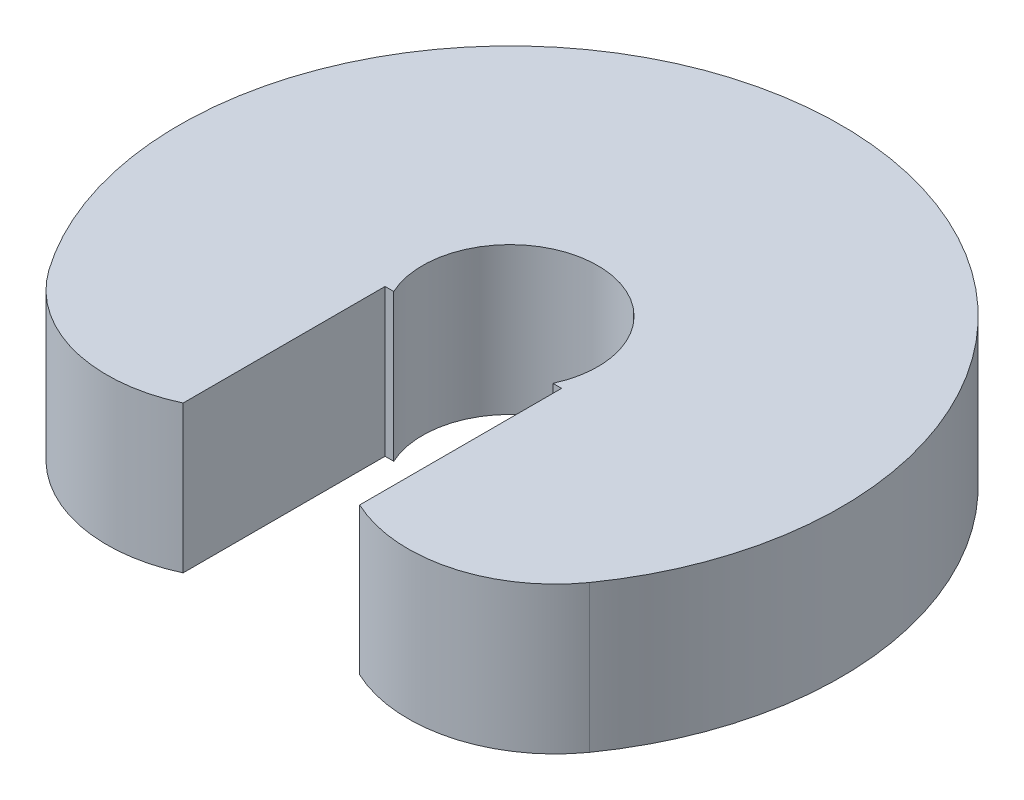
ISO-10303-21;
HEADER;
FILE_DESCRIPTION(('STEP AP214'),'2;1');
FILE_NAME('part.step','',(''),(''),'','','');
FILE_SCHEMA(('AUTOMOTIVE_DESIGN { 1 0 10303 214 1 1 1 1 }'));
ENDSEC;
DATA;
#1=APPLICATION_CONTEXT('core data for automotive mechanical design processes');
#2=APPLICATION_PROTOCOL_DEFINITION('international standard','automotive_design',2000,#1);
#3=PRODUCT_CONTEXT('',#1,'mechanical');
#4=PRODUCT('Part','Part','',(#3));
#5=PRODUCT_RELATED_PRODUCT_CATEGORY('part','',(#4));
#6=PRODUCT_DEFINITION_FORMATION('','',#4);
#7=PRODUCT_DEFINITION_CONTEXT('part definition',#1,'design');
#8=PRODUCT_DEFINITION('design','',#6,#7);
#9=PRODUCT_DEFINITION_SHAPE('','',#8);
#10=(LENGTH_UNIT() NAMED_UNIT(*) SI_UNIT(.MILLI.,.METRE.));
#11=(NAMED_UNIT(*) PLANE_ANGLE_UNIT() SI_UNIT($,.RADIAN.));
#12=(NAMED_UNIT(*) SI_UNIT($,.STERADIAN.) SOLID_ANGLE_UNIT());
#13=UNCERTAINTY_MEASURE_WITH_UNIT(LENGTH_MEASURE(1.E-05),#10,'distance_accuracy_value','');
#14=(GEOMETRIC_REPRESENTATION_CONTEXT(3) GLOBAL_UNCERTAINTY_ASSIGNED_CONTEXT((#13)) GLOBAL_UNIT_ASSIGNED_CONTEXT((#10,
#11,#12)) REPRESENTATION_CONTEXT('',''));
#15=CARTESIAN_POINT('',(0.,0.,0.));
#16=DIRECTION('',(0.,0.,1.));
#17=DIRECTION('',(1.,0.,0.));
#18=AXIS2_PLACEMENT_3D('',#15,#16,#17);
#19=CARTESIAN_POINT('',(0.,100.,0.));
#20=DIRECTION('',(0.,-1.,0.));
#21=DIRECTION('',(0.,0.,-1.));
#22=AXIS2_PLACEMENT_3D('',#19,#20,#21);
#23=CYLINDRICAL_SURFACE('',#22,225.);
#24=CARTESIAN_POINT('',(0.,0.,0.));
#25=DIRECTION('',(0.,1.,0.));
#26=DIRECTION('',(1.,0.,0.));
#27=AXIS2_PLACEMENT_3D('',#24,#25,#26);
#28=CIRCLE('',#27,225.);
#29=CARTESIAN_POINT('',(183.716642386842,0.,129.896864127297));
#30=VERTEX_POINT('',#29);
#31=CARTESIAN_POINT('',(-183.716642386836,0.,129.896864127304));
#32=VERTEX_POINT('',#31);
#33=EDGE_CURVE('E11',#30,#32,#28,.T.);
#34=ORIENTED_EDGE('',*,*,#33,.T.);
#35=DIRECTION('',(0.,-1.,0.));
#36=VECTOR('',#35,1.);
#37=CARTESIAN_POINT('',(-183.716642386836,100.,129.896864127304));
#38=LINE('',#37,#36);
#39=CARTESIAN_POINT('',(-183.716642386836,100.,129.896864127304));
#40=VERTEX_POINT('',#39);
#41=EDGE_CURVE('E41',#40,#32,#38,.T.);
#42=ORIENTED_EDGE('',*,*,#41,.F.);
#43=CARTESIAN_POINT('',(0.,100.,0.));
#44=DIRECTION('',(0.,1.,0.));
#45=DIRECTION('',(1.,0.,0.));
#46=AXIS2_PLACEMENT_3D('',#43,#44,#45);
#47=CIRCLE('',#46,225.);
#48=CARTESIAN_POINT('',(183.716642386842,100.,129.896864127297));
#49=VERTEX_POINT('',#48);
#50=EDGE_CURVE('E130',#49,#40,#47,.T.);
#51=ORIENTED_EDGE('',*,*,#50,.F.);
#52=DIRECTION('',(0.,-1.,0.));
#53=VECTOR('',#52,1.);
#54=CARTESIAN_POINT('',(183.716642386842,100.,129.896864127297));
#55=LINE('',#54,#53);
#56=EDGE_CURVE('E27',#49,#30,#55,.T.);
#57=ORIENTED_EDGE('',*,*,#56,.T.);
#58=EDGE_LOOP('',(#34,#42,#51,#57));
#59=FACE_BOUND('',#58,.T.);
#60=ADVANCED_FACE('F16',(#59),#23,.T.);
#61=CARTESIAN_POINT('',(-102.394005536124,100.,71.6970545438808));
#62=DIRECTION('',(0.,-1.,0.));
#63=DIRECTION('',(0.,0.,-1.));
#64=AXIS2_PLACEMENT_3D('',#61,#62,#63);
#65=CYLINDRICAL_SURFACE('',#64,100.002945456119);
#66=CARTESIAN_POINT('',(-102.394005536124,0.,71.6970545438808));
#67=DIRECTION('',(0.,1.,0.));
#68=DIRECTION('',(1.,0.,0.));
#69=AXIS2_PLACEMENT_3D('',#66,#67,#68);
#70=CIRCLE('',#69,100.002945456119);
#71=CARTESIAN_POINT('',(-60.,0.,162.269331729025));
#72=VERTEX_POINT('',#71);
#73=EDGE_CURVE('E133',#32,#72,#70,.T.);
#74=ORIENTED_EDGE('',*,*,#73,.T.);
#75=DIRECTION('',(0.,-1.,0.));
#76=VECTOR('',#75,1.);
#77=CARTESIAN_POINT('',(-60.,100.,162.269331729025));
#78=LINE('',#77,#76);
#79=CARTESIAN_POINT('',(-60.,100.,162.269331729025));
#80=VERTEX_POINT('',#79);
#81=EDGE_CURVE('E123',#80,#72,#78,.T.);
#82=ORIENTED_EDGE('',*,*,#81,.F.);
#83=CARTESIAN_POINT('',(-102.394005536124,100.,71.6970545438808));
#84=DIRECTION('',(0.,1.,0.));
#85=DIRECTION('',(1.,0.,0.));
#86=AXIS2_PLACEMENT_3D('',#83,#84,#85);
#87=CIRCLE('',#86,100.002945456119);
#88=EDGE_CURVE('E20',#40,#80,#87,.T.);
#89=ORIENTED_EDGE('',*,*,#88,.F.);
#90=ORIENTED_EDGE('',*,*,#41,.T.);
#91=EDGE_LOOP('',(#74,#82,#89,#90));
#92=FACE_BOUND('',#91,.T.);
#93=ADVANCED_FACE('F276',(#92),#65,.T.);
#94=CARTESIAN_POINT('',(-60.,100.,162.269331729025));
#95=DIRECTION('',(-1.,0.,0.));
#96=DIRECTION('',(0.,0.,1.));
#97=AXIS2_PLACEMENT_3D('',#94,#95,#96);
#98=PLANE('',#97);
#99=DIRECTION('',(0.,0.,-1.));
#100=VECTOR('',#99,1.);
#101=CARTESIAN_POINT('',(-60.,0.,162.269331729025));
#102=LINE('',#101,#100);
#103=CARTESIAN_POINT('',(-60.,0.,25.));
#104=VERTEX_POINT('',#103);
#105=EDGE_CURVE('E162',#72,#104,#102,.T.);
#106=ORIENTED_EDGE('',*,*,#105,.T.);
#107=DIRECTION('',(0.,-1.,0.));
#108=VECTOR('',#107,1.);
#109=CARTESIAN_POINT('',(-60.,100.,25.));
#110=LINE('',#109,#108);
#111=CARTESIAN_POINT('',(-60.,100.,25.));
#112=VERTEX_POINT('',#111);
#113=EDGE_CURVE('E159',#112,#104,#110,.T.);
#114=ORIENTED_EDGE('',*,*,#113,.F.);
#115=DIRECTION('',(0.,0.,-1.));
#116=VECTOR('',#115,1.);
#117=CARTESIAN_POINT('',(-60.,100.,162.269331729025));
#118=LINE('',#117,#116);
#119=EDGE_CURVE('E97',#80,#112,#118,.T.);
#120=ORIENTED_EDGE('',*,*,#119,.F.);
#121=ORIENTED_EDGE('',*,*,#81,.T.);
#122=EDGE_LOOP('',(#106,#114,#120,#121));
#123=FACE_BOUND('',#122,.T.);
#124=ADVANCED_FACE('F327',(#123),#98,.F.);
#125=CARTESIAN_POINT('',(-60.,100.,25.));
#126=DIRECTION('',(0.,0.,-1.));
#127=DIRECTION('',(-1.,0.,0.));
#128=AXIS2_PLACEMENT_3D('',#125,#126,#127);
#129=PLANE('',#128);
#130=DIRECTION('',(1.,0.,0.));
#131=VECTOR('',#130,1.);
#132=CARTESIAN_POINT('',(-60.,0.,25.));
#133=LINE('',#132,#131);
#134=CARTESIAN_POINT('',(-54.1032346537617,0.,25.));
#135=VERTEX_POINT('',#134);
#136=EDGE_CURVE('E156',#104,#135,#133,.T.);
#137=ORIENTED_EDGE('',*,*,#136,.T.);
#138=DIRECTION('',(0.,-1.,0.));
#139=VECTOR('',#138,1.);
#140=CARTESIAN_POINT('',(-54.1032346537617,100.,25.));
#141=LINE('',#140,#139);
#142=CARTESIAN_POINT('',(-54.1032346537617,100.,25.));
#143=VERTEX_POINT('',#142);
#144=EDGE_CURVE('E108',#143,#135,#141,.T.);
#145=ORIENTED_EDGE('',*,*,#144,.F.);
#146=DIRECTION('',(1.,0.,0.));
#147=VECTOR('',#146,1.);
#148=CARTESIAN_POINT('',(-60.,100.,25.));
#149=LINE('',#148,#147);
#150=EDGE_CURVE('E171',#112,#143,#149,.T.);
#151=ORIENTED_EDGE('',*,*,#150,.F.);
#152=ORIENTED_EDGE('',*,*,#113,.T.);
#153=EDGE_LOOP('',(#137,#145,#151,#152));
#154=FACE_BOUND('',#153,.T.);
#155=ADVANCED_FACE('F322',(#154),#129,.F.);
#156=CARTESIAN_POINT('',(0.,100.,0.));
#157=DIRECTION('',(0.,-1.,0.));
#158=DIRECTION('',(0.,0.,-1.));
#159=AXIS2_PLACEMENT_3D('',#156,#157,#158);
#160=CYLINDRICAL_SURFACE('',#159,59.6);
#161=CARTESIAN_POINT('',(0.,0.,0.));
#162=DIRECTION('',(0.,1.,0.));
#163=DIRECTION('',(1.,0.,0.));
#164=AXIS2_PLACEMENT_3D('',#161,#162,#163);
#165=CIRCLE('',#164,59.6);
#166=CARTESIAN_POINT('',(54.1032346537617,0.,25.));
#167=VERTEX_POINT('',#166);
#168=EDGE_CURVE('E176',#167,#135,#165,.T.);
#169=ORIENTED_EDGE('',*,*,#168,.F.);
#170=DIRECTION('',(0.,-1.,0.));
#171=VECTOR('',#170,1.);
#172=CARTESIAN_POINT('',(54.1032346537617,100.,25.));
#173=LINE('',#172,#171);
#174=CARTESIAN_POINT('',(54.1032346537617,100.,25.));
#175=VERTEX_POINT('',#174);
#176=EDGE_CURVE('E228',#175,#167,#173,.T.);
#177=ORIENTED_EDGE('',*,*,#176,.F.);
#178=CARTESIAN_POINT('',(0.,100.,0.));
#179=DIRECTION('',(0.,1.,0.));
#180=DIRECTION('',(1.,0.,0.));
#181=AXIS2_PLACEMENT_3D('',#178,#179,#180);
#182=CIRCLE('',#181,59.6);
#183=EDGE_CURVE('E169',#175,#143,#182,.T.);
#184=ORIENTED_EDGE('',*,*,#183,.T.);
#185=ORIENTED_EDGE('',*,*,#144,.T.);
#186=EDGE_LOOP('',(#169,#177,#184,#185));
#187=FACE_BOUND('',#186,.T.);
#188=ADVANCED_FACE('F18',(#187),#160,.F.);
#189=CARTESIAN_POINT('',(54.1032346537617,100.,25.));
#190=DIRECTION('',(0.,0.,-1.));
#191=DIRECTION('',(0.,-1.,0.));
#192=AXIS2_PLACEMENT_3D('',#189,#190,#191);
#193=PLANE('',#192);
#194=DIRECTION('',(1.,0.,0.));
#195=VECTOR('',#194,1.);
#196=CARTESIAN_POINT('',(54.1032346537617,0.,25.));
#197=LINE('',#196,#195);
#198=CARTESIAN_POINT('',(60.,0.,25.));
#199=VERTEX_POINT('',#198);
#200=EDGE_CURVE('E170',#167,#199,#197,.T.);
#201=ORIENTED_EDGE('',*,*,#200,.T.);
#202=DIRECTION('',(0.,-1.,0.));
#203=VECTOR('',#202,1.);
#204=CARTESIAN_POINT('',(60.,100.,25.));
#205=LINE('',#204,#203);
#206=CARTESIAN_POINT('',(60.,100.,25.));
#207=VERTEX_POINT('',#206);
#208=EDGE_CURVE('E143',#207,#199,#205,.T.);
#209=ORIENTED_EDGE('',*,*,#208,.F.);
#210=DIRECTION('',(1.,0.,0.));
#211=VECTOR('',#210,1.);
#212=CARTESIAN_POINT('',(54.1032346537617,100.,25.));
#213=LINE('',#212,#211);
#214=EDGE_CURVE('E76',#175,#207,#213,.T.);
#215=ORIENTED_EDGE('',*,*,#214,.F.);
#216=ORIENTED_EDGE('',*,*,#176,.T.);
#217=EDGE_LOOP('',(#201,#209,#215,#216));
#218=FACE_BOUND('',#217,.T.);
#219=ADVANCED_FACE('F281',(#218),#193,.F.);
#220=CARTESIAN_POINT('',(60.,100.,25.));
#221=DIRECTION('',(1.,0.,0.));
#222=DIRECTION('',(0.,1.,0.));
#223=AXIS2_PLACEMENT_3D('',#220,#221,#222);
#224=PLANE('',#223);
#225=DIRECTION('',(0.,0.,1.));
#226=VECTOR('',#225,1.);
#227=CARTESIAN_POINT('',(60.,0.,25.));
#228=LINE('',#227,#226);
#229=CARTESIAN_POINT('',(60.,0.,162.269331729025));
#230=VERTEX_POINT('',#229);
#231=EDGE_CURVE('E150',#199,#230,#228,.T.);
#232=ORIENTED_EDGE('',*,*,#231,.T.);
#233=DIRECTION('',(0.,-1.,0.));
#234=VECTOR('',#233,1.);
#235=CARTESIAN_POINT('',(60.,100.,162.269331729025));
#236=LINE('',#235,#234);
#237=CARTESIAN_POINT('',(60.,100.,162.269331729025));
#238=VERTEX_POINT('',#237);
#239=EDGE_CURVE('E90',#238,#230,#236,.T.);
#240=ORIENTED_EDGE('',*,*,#239,.F.);
#241=DIRECTION('',(0.,0.,1.));
#242=VECTOR('',#241,1.);
#243=CARTESIAN_POINT('',(60.,100.,25.));
#244=LINE('',#243,#242);
#245=EDGE_CURVE('E163',#207,#238,#244,.T.);
#246=ORIENTED_EDGE('',*,*,#245,.F.);
#247=ORIENTED_EDGE('',*,*,#208,.T.);
#248=EDGE_LOOP('',(#232,#240,#246,#247));
#249=FACE_BOUND('',#248,.T.);
#250=ADVANCED_FACE('F286',(#249),#224,.F.);
#251=CARTESIAN_POINT('',(102.394005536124,100.,71.6970545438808));
#252=DIRECTION('',(0.,-1.,0.));
#253=DIRECTION('',(0.,0.,-1.));
#254=AXIS2_PLACEMENT_3D('',#251,#252,#253);
#255=CYLINDRICAL_SURFACE('',#254,100.002945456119);
#256=CARTESIAN_POINT('',(102.394005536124,0.,71.6970545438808));
#257=DIRECTION('',(0.,1.,0.));
#258=DIRECTION('',(1.,0.,0.));
#259=AXIS2_PLACEMENT_3D('',#256,#257,#258);
#260=CIRCLE('',#259,100.002945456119);
#261=EDGE_CURVE('E139',#230,#30,#260,.T.);
#262=ORIENTED_EDGE('',*,*,#261,.T.);
#263=ORIENTED_EDGE('',*,*,#56,.F.);
#264=CARTESIAN_POINT('',(102.394005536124,100.,71.6970545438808));
#265=DIRECTION('',(0.,1.,0.));
#266=DIRECTION('',(1.,0.,0.));
#267=AXIS2_PLACEMENT_3D('',#264,#265,#266);
#268=CIRCLE('',#267,100.002945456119);
#269=EDGE_CURVE('E166',#238,#49,#268,.T.);
#270=ORIENTED_EDGE('',*,*,#269,.F.);
#271=ORIENTED_EDGE('',*,*,#239,.T.);
#272=EDGE_LOOP('',(#262,#263,#270,#271));
#273=FACE_BOUND('',#272,.T.);
#274=ADVANCED_FACE('F141',(#273),#255,.T.);
#275=CARTESIAN_POINT('',(0.,100.,0.));
#276=DIRECTION('',(0.,1.,0.));
#277=DIRECTION('',(1.,0.,0.));
#278=AXIS2_PLACEMENT_3D('',#275,#276,#277);
#279=PLANE('',#278);
#280=ORIENTED_EDGE('',*,*,#50,.T.);
#281=ORIENTED_EDGE('',*,*,#88,.T.);
#282=ORIENTED_EDGE('',*,*,#119,.T.);
#283=ORIENTED_EDGE('',*,*,#150,.T.);
#284=ORIENTED_EDGE('',*,*,#183,.F.);
#285=ORIENTED_EDGE('',*,*,#214,.T.);
#286=ORIENTED_EDGE('',*,*,#245,.T.);
#287=ORIENTED_EDGE('',*,*,#269,.T.);
#288=EDGE_LOOP('',(#280,#281,#282,#283,#284,#285,#286,#287));
#289=FACE_BOUND('',#288,.T.);
#290=ADVANCED_FACE('F297',(#289),#279,.T.);
#291=CARTESIAN_POINT('',(0.,0.,0.));
#292=DIRECTION('',(0.,1.,0.));
#293=DIRECTION('',(1.,0.,0.));
#294=AXIS2_PLACEMENT_3D('',#291,#292,#293);
#295=PLANE('',#294);
#296=ORIENTED_EDGE('',*,*,#33,.F.);
#297=ORIENTED_EDGE('',*,*,#261,.F.);
#298=ORIENTED_EDGE('',*,*,#231,.F.);
#299=ORIENTED_EDGE('',*,*,#200,.F.);
#300=ORIENTED_EDGE('',*,*,#168,.T.);
#301=ORIENTED_EDGE('',*,*,#136,.F.);
#302=ORIENTED_EDGE('',*,*,#105,.F.);
#303=ORIENTED_EDGE('',*,*,#73,.F.);
#304=EDGE_LOOP('',(#296,#297,#298,#299,#300,#301,#302,#303));
#305=FACE_BOUND('',#304,.T.);
#306=ADVANCED_FACE('F137',(#305),#295,.F.);
#307=CLOSED_SHELL('',(#60,#93,#124,#155,#188,#219,#250,#274,#290,#306));
#308=MANIFOLD_SOLID_BREP('B1',#307);
#309=ADVANCED_BREP_SHAPE_REPRESENTATION('',(#18,#308),#14);
#310=SHAPE_DEFINITION_REPRESENTATION(#9,#309);
ENDSEC;
END-ISO-10303-21;
